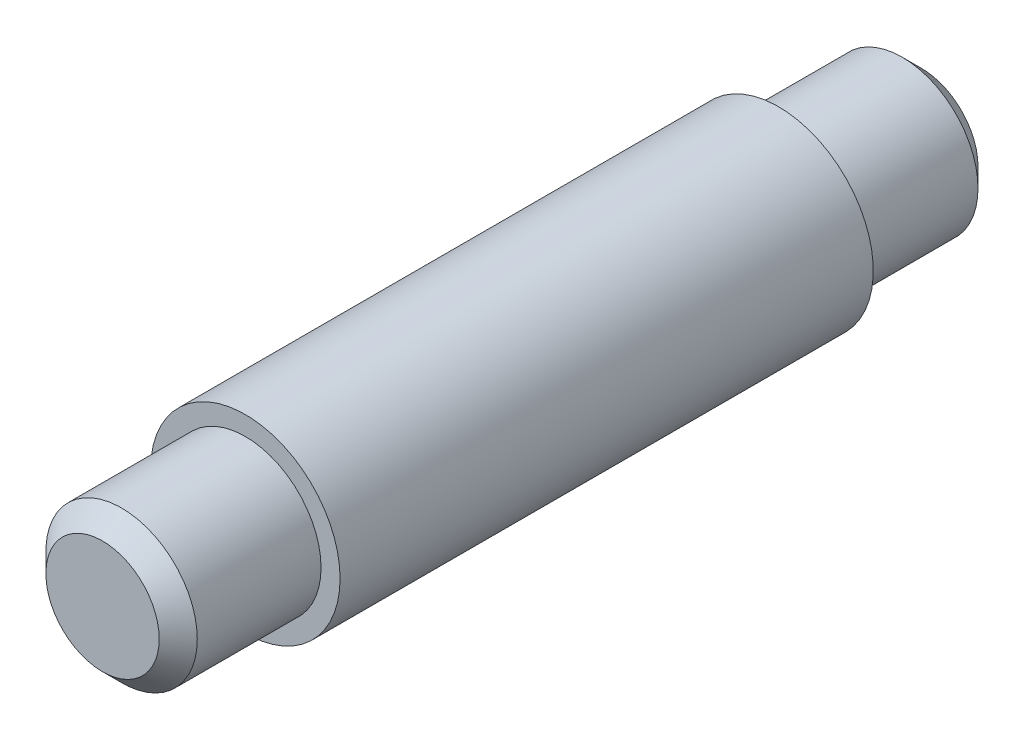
ISO-10303-21;
HEADER;
FILE_DESCRIPTION(('STEP AP214'),'2;1');
FILE_NAME('part.step','',(''),(''),'','','');
FILE_SCHEMA(('AUTOMOTIVE_DESIGN { 1 0 10303 214 1 1 1 1 }'));
ENDSEC;
DATA;
#1=APPLICATION_CONTEXT('core data for automotive mechanical design processes');
#2=APPLICATION_PROTOCOL_DEFINITION('international standard','automotive_design',2000,#1);
#3=PRODUCT_CONTEXT('',#1,'mechanical');
#4=PRODUCT('Part','Part','',(#3));
#5=PRODUCT_RELATED_PRODUCT_CATEGORY('part','',(#4));
#6=PRODUCT_DEFINITION_FORMATION('','',#4);
#7=PRODUCT_DEFINITION_CONTEXT('part definition',#1,'design');
#8=PRODUCT_DEFINITION('design','',#6,#7);
#9=PRODUCT_DEFINITION_SHAPE('','',#8);
#10=(LENGTH_UNIT() NAMED_UNIT(*) SI_UNIT(.MILLI.,.METRE.));
#11=(NAMED_UNIT(*) PLANE_ANGLE_UNIT() SI_UNIT($,.RADIAN.));
#12=(NAMED_UNIT(*) SI_UNIT($,.STERADIAN.) SOLID_ANGLE_UNIT());
#13=UNCERTAINTY_MEASURE_WITH_UNIT(LENGTH_MEASURE(1.E-05),#10,'distance_accuracy_value','');
#14=(GEOMETRIC_REPRESENTATION_CONTEXT(3) GLOBAL_UNCERTAINTY_ASSIGNED_CONTEXT((#13)) GLOBAL_UNIT_ASSIGNED_CONTEXT((#10,
#11,#12)) REPRESENTATION_CONTEXT('',''));
#15=CARTESIAN_POINT('',(0.,0.,0.));
#16=DIRECTION('',(0.,0.,1.));
#17=DIRECTION('',(1.,0.,0.));
#18=AXIS2_PLACEMENT_3D('',#15,#16,#17);
#19=CARTESIAN_POINT('',(0.,0.,43.));
#20=DIRECTION('',(0.,0.,-1.));
#21=DIRECTION('',(-1.,0.,0.));
#22=AXIS2_PLACEMENT_3D('',#19,#20,#21);
#23=CYLINDRICAL_SURFACE('',#22,9.95);
#24=CARTESIAN_POINT('',(0.,0.,28.));
#25=DIRECTION('',(0.,0.,1.));
#26=DIRECTION('',(1.,0.,0.));
#27=AXIS2_PLACEMENT_3D('',#24,#25,#26);
#28=CIRCLE('',#27,9.95);
#29=CARTESIAN_POINT('',(9.95,0.,28.));
#30=VERTEX_POINT('',#29);
#31=EDGE_CURVE('E62',#30,#30,#28,.T.);
#32=ORIENTED_EDGE('',*,*,#31,.F.);
#33=EDGE_LOOP('',(#32));
#34=FACE_BOUND('',#33,.T.);
#35=CARTESIAN_POINT('',(0.,0.,-28.));
#36=DIRECTION('',(0.,0.,-1.));
#37=DIRECTION('',(-1.,0.,0.));
#38=AXIS2_PLACEMENT_3D('',#35,#36,#37);
#39=CIRCLE('',#38,9.95);
#40=CARTESIAN_POINT('',(-9.95,0.,-28.));
#41=VERTEX_POINT('',#40);
#42=EDGE_CURVE('E68',#41,#41,#39,.T.);
#43=ORIENTED_EDGE('',*,*,#42,.F.);
#44=EDGE_LOOP('',(#43));
#45=FACE_BOUND('',#44,.T.);
#46=ADVANCED_FACE('F41',(#34,#45),#23,.T.);
#47=CARTESIAN_POINT('',(0.,0.,28.));
#48=DIRECTION('',(0.,0.,1.));
#49=DIRECTION('',(1.,0.,0.));
#50=AXIS2_PLACEMENT_3D('',#47,#48,#49);
#51=CYLINDRICAL_SURFACE('',#50,7.95);
#52=CARTESIAN_POINT('',(0.,0.,41.));
#53=DIRECTION('',(0.,0.,1.));
#54=DIRECTION('',(1.,0.,0.));
#55=AXIS2_PLACEMENT_3D('',#52,#53,#54);
#56=CIRCLE('',#55,7.95);
#57=CARTESIAN_POINT('',(7.95,0.,41.));
#58=VERTEX_POINT('',#57);
#59=EDGE_CURVE('E10',#58,#58,#56,.F.);
#60=ORIENTED_EDGE('',*,*,#59,.T.);
#61=EDGE_LOOP('',(#60));
#62=FACE_BOUND('',#61,.T.);
#63=CARTESIAN_POINT('',(0.,0.,28.));
#64=DIRECTION('',(0.,0.,1.));
#65=DIRECTION('',(1.,0.,0.));
#66=AXIS2_PLACEMENT_3D('',#63,#64,#65);
#67=CIRCLE('',#66,7.95);
#68=CARTESIAN_POINT('',(7.95,0.,28.));
#69=VERTEX_POINT('',#68);
#70=EDGE_CURVE('E65',#69,#69,#67,.T.);
#71=ORIENTED_EDGE('',*,*,#70,.T.);
#72=EDGE_LOOP('',(#71));
#73=FACE_BOUND('',#72,.T.);
#74=ADVANCED_FACE('F85',(#62,#73),#51,.T.);
#75=CARTESIAN_POINT('',(0.,0.,28.));
#76=DIRECTION('',(0.,0.,1.));
#77=DIRECTION('',(1.,0.,0.));
#78=AXIS2_PLACEMENT_3D('',#75,#76,#77);
#79=PLANE('',#78);
#80=ORIENTED_EDGE('',*,*,#70,.F.);
#81=EDGE_LOOP('',(#80));
#82=FACE_BOUND('',#81,.T.);
#83=ORIENTED_EDGE('',*,*,#31,.T.);
#84=EDGE_LOOP('',(#83));
#85=FACE_BOUND('',#84,.T.);
#86=ADVANCED_FACE('F92',(#82,#85),#79,.T.);
#87=CARTESIAN_POINT('',(0.,0.,43.));
#88=DIRECTION('',(0.,0.,1.));
#89=DIRECTION('',(1.,0.,0.));
#90=AXIS2_PLACEMENT_3D('',#87,#88,#89);
#91=PLANE('',#90);
#92=CARTESIAN_POINT('',(0.,0.,43.));
#93=DIRECTION('',(0.,0.,1.));
#94=DIRECTION('',(1.,0.,0.));
#95=AXIS2_PLACEMENT_3D('',#92,#93,#94);
#96=CIRCLE('',#95,5.95);
#97=CARTESIAN_POINT('',(5.95,0.,43.));
#98=VERTEX_POINT('',#97);
#99=EDGE_CURVE('E49',#98,#98,#96,.T.);
#100=ORIENTED_EDGE('',*,*,#99,.T.);
#101=EDGE_LOOP('',(#100));
#102=FACE_BOUND('',#101,.T.);
#103=ADVANCED_FACE('F114',(#102),#91,.T.);
#104=CARTESIAN_POINT('',(0.,0.,-28.));
#105=DIRECTION('',(0.,0.,-1.));
#106=DIRECTION('',(-1.,0.,0.));
#107=AXIS2_PLACEMENT_3D('',#104,#105,#106);
#108=CYLINDRICAL_SURFACE('',#107,7.95);
#109=CARTESIAN_POINT('',(0.,0.,-41.));
#110=DIRECTION('',(0.,0.,1.));
#111=DIRECTION('',(1.,0.,0.));
#112=AXIS2_PLACEMENT_3D('',#109,#110,#111);
#113=CIRCLE('',#112,7.95);
#114=CARTESIAN_POINT('',(7.95,0.,-41.));
#115=VERTEX_POINT('',#114);
#116=EDGE_CURVE('E53',#115,#115,#113,.T.);
#117=ORIENTED_EDGE('',*,*,#116,.T.);
#118=EDGE_LOOP('',(#117));
#119=FACE_BOUND('',#118,.T.);
#120=CARTESIAN_POINT('',(0.,0.,-28.));
#121=DIRECTION('',(0.,0.,-1.));
#122=DIRECTION('',(-1.,0.,0.));
#123=AXIS2_PLACEMENT_3D('',#120,#121,#122);
#124=CIRCLE('',#123,7.95);
#125=CARTESIAN_POINT('',(-7.95,0.,-28.));
#126=VERTEX_POINT('',#125);
#127=EDGE_CURVE('E71',#126,#126,#124,.T.);
#128=ORIENTED_EDGE('',*,*,#127,.T.);
#129=EDGE_LOOP('',(#128));
#130=FACE_BOUND('',#129,.T.);
#131=ADVANCED_FACE('F75',(#119,#130),#108,.T.);
#132=CARTESIAN_POINT('',(0.,0.,-28.));
#133=DIRECTION('',(0.,0.,-1.));
#134=DIRECTION('',(-1.,0.,0.));
#135=AXIS2_PLACEMENT_3D('',#132,#133,#134);
#136=PLANE('',#135);
#137=ORIENTED_EDGE('',*,*,#127,.F.);
#138=EDGE_LOOP('',(#137));
#139=FACE_BOUND('',#138,.T.);
#140=ORIENTED_EDGE('',*,*,#42,.T.);
#141=EDGE_LOOP('',(#140));
#142=FACE_BOUND('',#141,.T.);
#143=ADVANCED_FACE('F77',(#139,#142),#136,.T.);
#144=CARTESIAN_POINT('',(0.,0.,-43.));
#145=DIRECTION('',(0.,0.,1.));
#146=DIRECTION('',(1.,0.,0.));
#147=AXIS2_PLACEMENT_3D('',#144,#145,#146);
#148=PLANE('',#147);
#149=CARTESIAN_POINT('',(0.,0.,-43.));
#150=DIRECTION('',(0.,0.,1.));
#151=DIRECTION('',(1.,0.,0.));
#152=AXIS2_PLACEMENT_3D('',#149,#150,#151);
#153=CIRCLE('',#152,5.95);
#154=CARTESIAN_POINT('',(5.95,0.,-43.));
#155=VERTEX_POINT('',#154);
#156=EDGE_CURVE('E57',#155,#155,#153,.F.);
#157=ORIENTED_EDGE('',*,*,#156,.T.);
#158=EDGE_LOOP('',(#157));
#159=FACE_BOUND('',#158,.T.);
#160=ADVANCED_FACE('F80',(#159),#148,.F.);
#161=CARTESIAN_POINT('',(0.,0.,-43.));
#162=DIRECTION('',(0.,0.,1.));
#163=DIRECTION('',(1.,0.,0.));
#164=AXIS2_PLACEMENT_3D('',#161,#162,#163);
#165=CONICAL_SURFACE('',#164,5.95,0.785398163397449);
#166=ORIENTED_EDGE('',*,*,#116,.F.);
#167=EDGE_LOOP('',(#166));
#168=FACE_BOUND('',#167,.T.);
#169=ORIENTED_EDGE('',*,*,#156,.F.);
#170=EDGE_LOOP('',(#169));
#171=FACE_BOUND('',#170,.T.);
#172=ADVANCED_FACE('F98',(#168,#171),#165,.T.);
#173=CARTESIAN_POINT('',(0.,0.,43.));
#174=DIRECTION('',(0.,0.,-1.));
#175=DIRECTION('',(-1.,0.,0.));
#176=AXIS2_PLACEMENT_3D('',#173,#174,#175);
#177=CONICAL_SURFACE('',#176,5.95,0.785398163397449);
#178=ORIENTED_EDGE('',*,*,#59,.F.);
#179=EDGE_LOOP('',(#178));
#180=FACE_BOUND('',#179,.T.);
#181=ORIENTED_EDGE('',*,*,#99,.F.);
#182=EDGE_LOOP('',(#181));
#183=FACE_BOUND('',#182,.T.);
#184=ADVANCED_FACE('F44',(#180,#183),#177,.T.);
#185=CLOSED_SHELL('',(#46,#74,#86,#103,#131,#143,#160,#172,#184));
#186=MANIFOLD_SOLID_BREP('B2',#185);
#187=ADVANCED_BREP_SHAPE_REPRESENTATION('',(#18,#186),#14);
#188=SHAPE_DEFINITION_REPRESENTATION(#9,#187);
ENDSEC;
END-ISO-10303-21;
